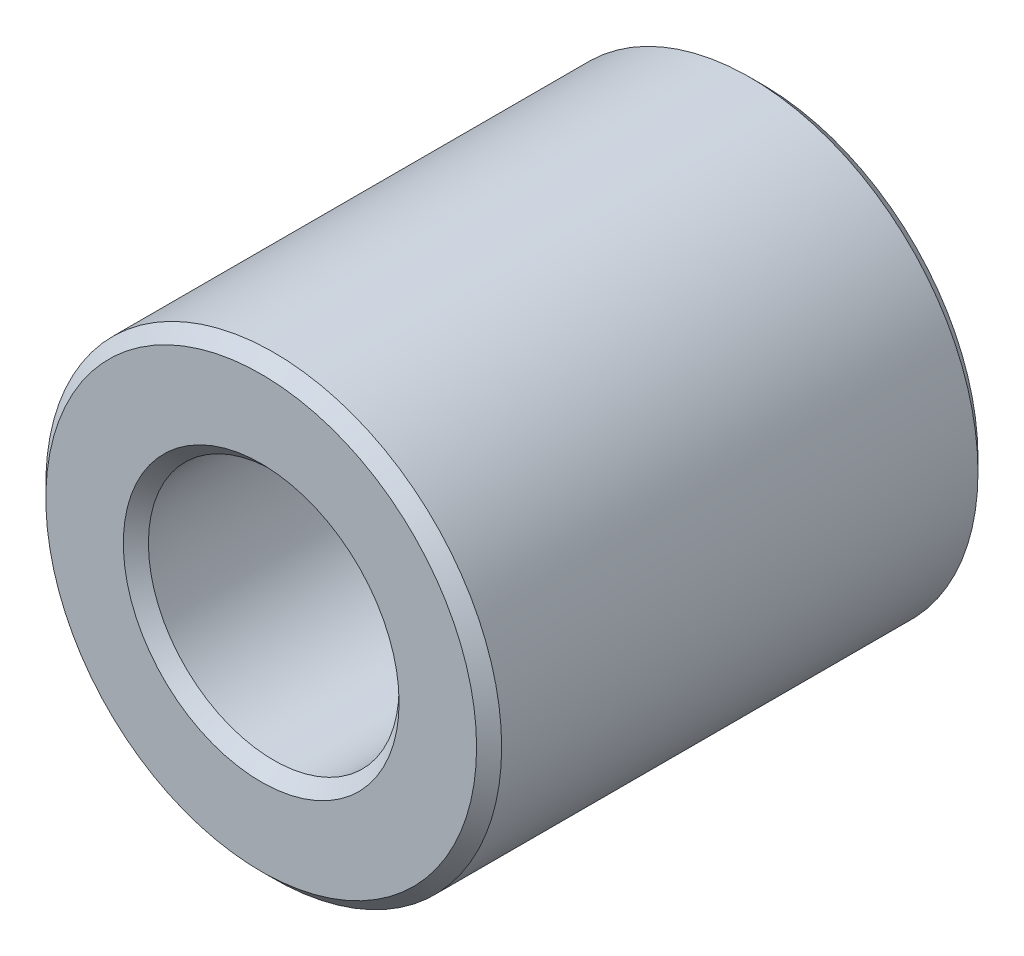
from build123d import *

# Parameters (mm, degrees)
SKETCH1_R           = 40
SKETCH1_R_2         = 22
BOSS_EXTRUDE1_DEPTH = 44
CHAMFER1_SIZE       = 2.2


with BuildPart() as part:
    # Sketch1 → Boss-Extrude1 (new, symmetric)
    with BuildSketch(Plane.XY):
        Circle(SKETCH1_R)
        Circle(SKETCH1_R_2, mode=Mode.SUBTRACT)
    extrude(amount=BOSS_EXTRUDE1_DEPTH, both=True)

    # Chamfer1
    chamfer1_edges = [part.edges().sort_by_distance(p)[0] for p in [
        (-40, 0, -44),
        (-40, 0, 44),
        (-22, 0, -44),
        (-22, 0, 44),
    ]]
    chamfer(chamfer1_edges, length=CHAMFER1_SIZE)


solid = part.part
